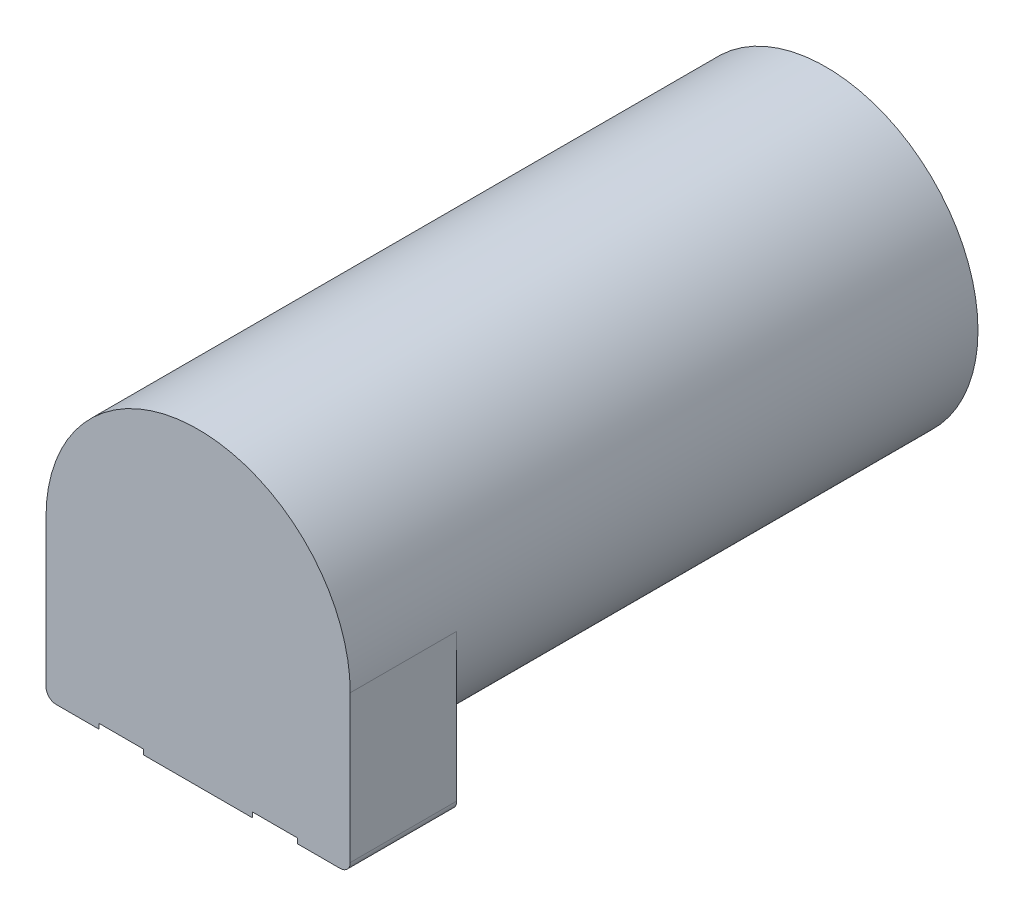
ISO-10303-21;
HEADER;
FILE_DESCRIPTION(('STEP AP214'),'2;1');
FILE_NAME('part.step','',(''),(''),'','','');
FILE_SCHEMA(('AUTOMOTIVE_DESIGN { 1 0 10303 214 1 1 1 1 }'));
ENDSEC;
DATA;
#1=APPLICATION_CONTEXT('core data for automotive mechanical design processes');
#2=APPLICATION_PROTOCOL_DEFINITION('international standard','automotive_design',2000,#1);
#3=PRODUCT_CONTEXT('',#1,'mechanical');
#4=PRODUCT('Part','Part','',(#3));
#5=PRODUCT_RELATED_PRODUCT_CATEGORY('part','',(#4));
#6=PRODUCT_DEFINITION_FORMATION('','',#4);
#7=PRODUCT_DEFINITION_CONTEXT('part definition',#1,'design');
#8=PRODUCT_DEFINITION('design','',#6,#7);
#9=PRODUCT_DEFINITION_SHAPE('','',#8);
#10=(LENGTH_UNIT() NAMED_UNIT(*) SI_UNIT(.MILLI.,.METRE.));
#11=(NAMED_UNIT(*) PLANE_ANGLE_UNIT() SI_UNIT($,.RADIAN.));
#12=(NAMED_UNIT(*) SI_UNIT($,.STERADIAN.) SOLID_ANGLE_UNIT());
#13=UNCERTAINTY_MEASURE_WITH_UNIT(LENGTH_MEASURE(1.E-05),#10,'distance_accuracy_value','');
#14=(GEOMETRIC_REPRESENTATION_CONTEXT(3) GLOBAL_UNCERTAINTY_ASSIGNED_CONTEXT((#13)) GLOBAL_UNIT_ASSIGNED_CONTEXT((#10,
#11,#12)) REPRESENTATION_CONTEXT('',''));
#15=CARTESIAN_POINT('',(0.,0.,0.));
#16=DIRECTION('',(0.,0.,1.));
#17=DIRECTION('',(1.,0.,0.));
#18=AXIS2_PLACEMENT_3D('',#15,#16,#17);
#19=CARTESIAN_POINT('',(-28.,-31.,102.8));
#20=DIRECTION('',(0.,-1.,0.));
#21=DIRECTION('',(1.,0.,0.));
#22=AXIS2_PLACEMENT_3D('',#19,#20,#21);
#23=PLANE('',#22);
#24=CARTESIAN_POINT('',(15.15,-31.,112.1));
#25=DIRECTION('',(0.,-1.,0.));
#26=DIRECTION('',(1.,0.,0.));
#27=AXIS2_PLACEMENT_3D('',#24,#25,#26);
#28=CIRCLE('',#27,12.5);
#29=CARTESIAN_POINT('',(10.75,-31.,123.8));
#30=VERTEX_POINT('',#29);
#31=CARTESIAN_POINT('',(6.79775479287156,-31.,102.8));
#32=VERTEX_POINT('',#31);
#33=EDGE_CURVE('E181',#30,#32,#28,.T.);
#34=ORIENTED_EDGE('',*,*,#33,.F.);
#35=DIRECTION('',(1.,0.,0.));
#36=VECTOR('',#35,1.);
#37=CARTESIAN_POINT('',(-28.,-31.,123.8));
#38=LINE('',#37,#36);
#39=CARTESIAN_POINT('',(-10.75,-31.,123.8));
#40=VERTEX_POINT('',#39);
#41=EDGE_CURVE('E216',#40,#30,#38,.T.);
#42=ORIENTED_EDGE('',*,*,#41,.F.);
#43=CARTESIAN_POINT('',(-15.15,-31.,112.1));
#44=DIRECTION('',(0.,-1.,0.));
#45=DIRECTION('',(1.,0.,0.));
#46=AXIS2_PLACEMENT_3D('',#43,#44,#45);
#47=CIRCLE('',#46,12.5);
#48=CARTESIAN_POINT('',(-6.79775479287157,-31.,102.8));
#49=VERTEX_POINT('',#48);
#50=EDGE_CURVE('E192',#49,#40,#47,.T.);
#51=ORIENTED_EDGE('',*,*,#50,.F.);
#52=DIRECTION('',(1.,0.,0.));
#53=VECTOR('',#52,1.);
#54=CARTESIAN_POINT('',(-28.,-31.,102.8));
#55=LINE('',#54,#53);
#56=EDGE_CURVE('E235',#49,#32,#55,.T.);
#57=ORIENTED_EDGE('',*,*,#56,.T.);
#58=EDGE_LOOP('',(#34,#42,#51,#57));
#59=FACE_BOUND('',#58,.T.);
#60=ADVANCED_FACE('F32',(#59),#23,.T.);
#61=CARTESIAN_POINT('',(-19.55,-31.,123.8));
#62=VERTEX_POINT('',#61);
#63=CARTESIAN_POINT('',(-23.5022452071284,-31.,102.8));
#64=VERTEX_POINT('',#63);
#65=EDGE_CURVE('E194',#62,#64,#47,.T.);
#66=ORIENTED_EDGE('',*,*,#65,.F.);
#67=CARTESIAN_POINT('',(-28.,-31.,123.8));
#68=VERTEX_POINT('',#67);
#69=EDGE_CURVE('E212',#68,#62,#38,.T.);
#70=ORIENTED_EDGE('',*,*,#69,.F.);
#71=DIRECTION('',(0.,0.,1.));
#72=VECTOR('',#71,1.);
#73=CARTESIAN_POINT('',(-28.,-31.,102.8));
#74=LINE('',#73,#72);
#75=CARTESIAN_POINT('',(-28.,-31.,102.8));
#76=VERTEX_POINT('',#75);
#77=EDGE_CURVE('E251',#76,#68,#74,.T.);
#78=ORIENTED_EDGE('',*,*,#77,.F.);
#79=EDGE_CURVE('E231',#76,#64,#55,.T.);
#80=ORIENTED_EDGE('',*,*,#79,.T.);
#81=EDGE_LOOP('',(#66,#70,#78,#80));
#82=FACE_BOUND('',#81,.T.);
#83=ADVANCED_FACE('F293',(#82),#23,.T.);
#84=CARTESIAN_POINT('',(0.,15.75,-5.));
#85=DIRECTION('',(0.,0.,1.));
#86=DIRECTION('',(1.,0.,0.));
#87=AXIS2_PLACEMENT_3D('',#84,#85,#86);
#88=PLANE('',#87);
#89=CARTESIAN_POINT('',(0.,0.,-5.));
#90=DIRECTION('',(0.,0.,1.));
#91=DIRECTION('',(1.,0.,0.));
#92=AXIS2_PLACEMENT_3D('',#89,#90,#91);
#93=CIRCLE('',#92,14.75);
#94=CARTESIAN_POINT('',(14.75,0.,-5.));
#95=VERTEX_POINT('',#94);
#96=EDGE_CURVE('E11',#95,#95,#93,.F.);
#97=ORIENTED_EDGE('',*,*,#96,.T.);
#98=EDGE_LOOP('',(#97));
#99=FACE_BOUND('',#98,.T.);
#100=ADVANCED_FACE('F34',(#99),#88,.F.);
#101=CARTESIAN_POINT('',(0.,0.,0.));
#102=DIRECTION('',(0.,0.,1.));
#103=DIRECTION('',(1.,0.,0.));
#104=AXIS2_PLACEMENT_3D('',#101,#102,#103);
#105=CYLINDRICAL_SURFACE('',#104,15.75);
#106=CARTESIAN_POINT('',(0.,0.,-4.00000000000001));
#107=DIRECTION('',(0.,0.,1.));
#108=DIRECTION('',(1.,0.,0.));
#109=AXIS2_PLACEMENT_3D('',#106,#107,#108);
#110=CIRCLE('',#109,15.75);
#111=CARTESIAN_POINT('',(15.75,0.,-4.00000000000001));
#112=VERTEX_POINT('',#111);
#113=EDGE_CURVE('E40',#112,#112,#110,.T.);
#114=ORIENTED_EDGE('',*,*,#113,.T.);
#115=EDGE_LOOP('',(#114));
#116=FACE_BOUND('',#115,.T.);
#117=CARTESIAN_POINT('',(0.,0.,0.));
#118=DIRECTION('',(0.,0.,1.));
#119=DIRECTION('',(1.,0.,0.));
#120=AXIS2_PLACEMENT_3D('',#117,#118,#119);
#121=CIRCLE('',#120,15.75);
#122=CARTESIAN_POINT('',(15.75,0.,0.));
#123=VERTEX_POINT('',#122);
#124=EDGE_CURVE('E262',#123,#123,#121,.T.);
#125=ORIENTED_EDGE('',*,*,#124,.F.);
#126=EDGE_LOOP('',(#125));
#127=FACE_BOUND('',#126,.T.);
#128=ADVANCED_FACE('F283',(#116,#127),#105,.T.);
#129=CARTESIAN_POINT('',(0.,0.,0.));
#130=DIRECTION('',(0.,0.,1.));
#131=DIRECTION('',(1.,0.,0.));
#132=AXIS2_PLACEMENT_3D('',#129,#130,#131);
#133=PLANE('',#132);
#134=CARTESIAN_POINT('',(0.,-22.5,0.));
#135=DIRECTION('',(0.,0.,-1.));
#136=DIRECTION('',(-1.,0.,0.));
#137=AXIS2_PLACEMENT_3D('',#134,#135,#136);
#138=CIRCLE('',#137,2.49999999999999);
#139=CARTESIAN_POINT('',(-2.5,-22.5,0.));
#140=VERTEX_POINT('',#139);
#141=EDGE_CURVE('E150',#140,#140,#138,.T.);
#142=ORIENTED_EDGE('',*,*,#141,.F.);
#143=EDGE_LOOP('',(#142));
#144=FACE_BOUND('',#143,.T.);
#145=CARTESIAN_POINT('',(-15.9099025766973,15.9099025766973,0.));
#146=DIRECTION('',(0.,0.,-1.));
#147=DIRECTION('',(-1.,0.,0.));
#148=AXIS2_PLACEMENT_3D('',#145,#146,#147);
#149=CIRCLE('',#148,2.49999999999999);
#150=CARTESIAN_POINT('',(-18.4099025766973,15.9099025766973,0.));
#151=VERTEX_POINT('',#150);
#152=EDGE_CURVE('E158',#151,#151,#149,.T.);
#153=ORIENTED_EDGE('',*,*,#152,.F.);
#154=EDGE_LOOP('',(#153));
#155=FACE_BOUND('',#154,.T.);
#156=CARTESIAN_POINT('',(15.9099025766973,15.9099025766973,0.));
#157=DIRECTION('',(0.,0.,-1.));
#158=DIRECTION('',(-1.,0.,0.));
#159=AXIS2_PLACEMENT_3D('',#156,#157,#158);
#160=CIRCLE('',#159,2.49999999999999);
#161=CARTESIAN_POINT('',(13.4099025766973,15.9099025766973,0.));
#162=VERTEX_POINT('',#161);
#163=EDGE_CURVE('E164',#162,#162,#160,.T.);
#164=ORIENTED_EDGE('',*,*,#163,.F.);
#165=EDGE_LOOP('',(#164));
#166=FACE_BOUND('',#165,.T.);
#167=CARTESIAN_POINT('',(0.,0.,0.));
#168=DIRECTION('',(0.,0.,1.));
#169=DIRECTION('',(1.,0.,0.));
#170=AXIS2_PLACEMENT_3D('',#167,#168,#169);
#171=CIRCLE('',#170,30.);
#172=CARTESIAN_POINT('',(30.,0.,0.));
#173=VERTEX_POINT('',#172);
#174=EDGE_CURVE('E245',#173,#173,#171,.T.);
#175=ORIENTED_EDGE('',*,*,#174,.F.);
#176=EDGE_LOOP('',(#175));
#177=FACE_BOUND('',#176,.T.);
#178=ORIENTED_EDGE('',*,*,#124,.T.);
#179=EDGE_LOOP('',(#178));
#180=FACE_BOUND('',#179,.T.);
#181=ADVANCED_FACE('F381',(#144,#155,#166,#177,#180),#133,.F.);
#182=CARTESIAN_POINT('',(0.,0.,123.8));
#183=DIRECTION('',(0.,0.,-1.));
#184=DIRECTION('',(-1.,0.,0.));
#185=AXIS2_PLACEMENT_3D('',#182,#183,#184);
#186=CYLINDRICAL_SURFACE('',#185,30.);
#187=CARTESIAN_POINT('',(0.,0.,123.8));
#188=DIRECTION('',(0.,0.,1.));
#189=DIRECTION('',(1.,0.,0.));
#190=AXIS2_PLACEMENT_3D('',#187,#188,#189);
#191=CIRCLE('',#190,30.);
#192=CARTESIAN_POINT('',(30.,0.,123.8));
#193=VERTEX_POINT('',#192);
#194=CARTESIAN_POINT('',(-30.,0.,123.8));
#195=VERTEX_POINT('',#194);
#196=EDGE_CURVE('E259',#193,#195,#191,.T.);
#197=ORIENTED_EDGE('',*,*,#196,.F.);
#198=DIRECTION('',(0.,0.,1.));
#199=VECTOR('',#198,1.);
#200=CARTESIAN_POINT('',(30.,0.,102.8));
#201=LINE('',#200,#199);
#202=CARTESIAN_POINT('',(30.,0.,102.8));
#203=VERTEX_POINT('',#202);
#204=EDGE_CURVE('E242',#203,#193,#201,.T.);
#205=ORIENTED_EDGE('',*,*,#204,.F.);
#206=CARTESIAN_POINT('',(0.,0.,102.8));
#207=DIRECTION('',(0.,0.,-1.));
#208=DIRECTION('',(1.,0.,0.));
#209=AXIS2_PLACEMENT_3D('',#206,#207,#208);
#210=CIRCLE('',#209,30.);
#211=CARTESIAN_POINT('',(-30.,0.,102.8));
#212=VERTEX_POINT('',#211);
#213=EDGE_CURVE('E221',#203,#212,#210,.T.);
#214=ORIENTED_EDGE('',*,*,#213,.T.);
#215=DIRECTION('',(0.,0.,1.));
#216=VECTOR('',#215,1.);
#217=CARTESIAN_POINT('',(-30.,0.,102.8));
#218=LINE('',#217,#216);
#219=EDGE_CURVE('E241',#212,#195,#218,.T.);
#220=ORIENTED_EDGE('',*,*,#219,.T.);
#221=EDGE_LOOP('',(#197,#205,#214,#220));
#222=FACE_BOUND('',#221,.T.);
#223=ORIENTED_EDGE('',*,*,#174,.T.);
#224=EDGE_LOOP('',(#223));
#225=FACE_BOUND('',#224,.T.);
#226=ADVANCED_FACE('F345',(#222,#225),#186,.T.);
#227=CARTESIAN_POINT('',(0.,0.,123.8));
#228=DIRECTION('',(0.,0.,1.));
#229=DIRECTION('',(1.,0.,0.));
#230=AXIS2_PLACEMENT_3D('',#227,#228,#229);
#231=PLANE('',#230);
#232=DIRECTION('',(0.,-1.,0.));
#233=VECTOR('',#232,1.);
#234=CARTESIAN_POINT('',(10.75,-30.,123.8));
#235=LINE('',#234,#233);
#236=CARTESIAN_POINT('',(10.75,-30.,123.8));
#237=VERTEX_POINT('',#236);
#238=EDGE_CURVE('E190',#237,#30,#235,.T.);
#239=ORIENTED_EDGE('',*,*,#238,.F.);
#240=DIRECTION('',(1.,0.,0.));
#241=VECTOR('',#240,1.);
#242=CARTESIAN_POINT('',(0.,-30.,123.8));
#243=LINE('',#242,#241);
#244=CARTESIAN_POINT('',(19.55,-30.,123.8));
#245=VERTEX_POINT('',#244);
#246=EDGE_CURVE('E185',#237,#245,#243,.T.);
#247=ORIENTED_EDGE('',*,*,#246,.T.);
#248=DIRECTION('',(0.,-1.,0.));
#249=VECTOR('',#248,1.);
#250=CARTESIAN_POINT('',(19.55,-30.,123.8));
#251=LINE('',#250,#249);
#252=CARTESIAN_POINT('',(19.55,-31.,123.8));
#253=VERTEX_POINT('',#252);
#254=EDGE_CURVE('E188',#253,#245,#251,.F.);
#255=ORIENTED_EDGE('',*,*,#254,.F.);
#256=CARTESIAN_POINT('',(28.,-31.,123.8));
#257=VERTEX_POINT('',#256);
#258=EDGE_CURVE('E211',#253,#257,#38,.T.);
#259=ORIENTED_EDGE('',*,*,#258,.T.);
#260=CARTESIAN_POINT('',(28.,-29.,123.8));
#261=DIRECTION('',(0.,0.,1.));
#262=DIRECTION('',(1.,0.,0.));
#263=AXIS2_PLACEMENT_3D('',#260,#261,#262);
#264=CIRCLE('',#263,2.00000000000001);
#265=CARTESIAN_POINT('',(30.,-29.,123.8));
#266=VERTEX_POINT('',#265);
#267=EDGE_CURVE('E215',#257,#266,#264,.T.);
#268=ORIENTED_EDGE('',*,*,#267,.T.);
#269=DIRECTION('',(0.,1.,0.));
#270=VECTOR('',#269,1.);
#271=CARTESIAN_POINT('',(30.,-29.,123.8));
#272=LINE('',#271,#270);
#273=EDGE_CURVE('E219',#266,#193,#272,.T.);
#274=ORIENTED_EDGE('',*,*,#273,.T.);
#275=ORIENTED_EDGE('',*,*,#196,.T.);
#276=DIRECTION('',(0.,-1.,0.));
#277=VECTOR('',#276,1.);
#278=CARTESIAN_POINT('',(-30.,0.,123.8));
#279=LINE('',#278,#277);
#280=CARTESIAN_POINT('',(-30.,-29.,123.8));
#281=VERTEX_POINT('',#280);
#282=EDGE_CURVE('E205',#195,#281,#279,.T.);
#283=ORIENTED_EDGE('',*,*,#282,.T.);
#284=CARTESIAN_POINT('',(-28.,-29.,123.8));
#285=DIRECTION('',(0.,0.,1.));
#286=DIRECTION('',(1.,0.,0.));
#287=AXIS2_PLACEMENT_3D('',#284,#285,#286);
#288=CIRCLE('',#287,2.);
#289=EDGE_CURVE('E208',#281,#68,#288,.T.);
#290=ORIENTED_EDGE('',*,*,#289,.T.);
#291=ORIENTED_EDGE('',*,*,#69,.T.);
#292=DIRECTION('',(0.,-1.,0.));
#293=VECTOR('',#292,1.);
#294=CARTESIAN_POINT('',(-19.55,-30.,123.8));
#295=LINE('',#294,#293);
#296=CARTESIAN_POINT('',(-19.55,-30.,123.8));
#297=VERTEX_POINT('',#296);
#298=EDGE_CURVE('E203',#297,#62,#295,.T.);
#299=ORIENTED_EDGE('',*,*,#298,.F.);
#300=DIRECTION('',(1.,0.,0.));
#301=VECTOR('',#300,1.);
#302=CARTESIAN_POINT('',(0.,-30.,123.8));
#303=LINE('',#302,#301);
#304=CARTESIAN_POINT('',(-10.75,-30.,123.8));
#305=VERTEX_POINT('',#304);
#306=EDGE_CURVE('E198',#297,#305,#303,.T.);
#307=ORIENTED_EDGE('',*,*,#306,.T.);
#308=DIRECTION('',(0.,-1.,0.));
#309=VECTOR('',#308,1.);
#310=CARTESIAN_POINT('',(-10.75,-30.,123.8));
#311=LINE('',#310,#309);
#312=EDGE_CURVE('E201',#40,#305,#311,.F.);
#313=ORIENTED_EDGE('',*,*,#312,.F.);
#314=ORIENTED_EDGE('',*,*,#41,.T.);
#315=EDGE_LOOP('',(#239,#247,#255,#259,#268,#274,#275,#283,#290,#291,#299,#307,#313,#314));
#316=FACE_BOUND('',#315,.T.);
#317=ADVANCED_FACE('F337',(#316),#231,.T.);
#318=CARTESIAN_POINT('',(30.,-29.,102.8));
#319=DIRECTION('',(1.,0.,0.));
#320=DIRECTION('',(0.,1.,0.));
#321=AXIS2_PLACEMENT_3D('',#318,#319,#320);
#322=PLANE('',#321);
#323=ORIENTED_EDGE('',*,*,#273,.F.);
#324=DIRECTION('',(0.,0.,1.));
#325=VECTOR('',#324,1.);
#326=CARTESIAN_POINT('',(30.,-29.,102.8));
#327=LINE('',#326,#325);
#328=CARTESIAN_POINT('',(30.,-29.,102.8));
#329=VERTEX_POINT('',#328);
#330=EDGE_CURVE('E246',#329,#266,#327,.T.);
#331=ORIENTED_EDGE('',*,*,#330,.F.);
#332=DIRECTION('',(0.,1.,0.));
#333=VECTOR('',#332,1.);
#334=CARTESIAN_POINT('',(30.,-29.,102.8));
#335=LINE('',#334,#333);
#336=EDGE_CURVE('E238',#329,#203,#335,.T.);
#337=ORIENTED_EDGE('',*,*,#336,.T.);
#338=ORIENTED_EDGE('',*,*,#204,.T.);
#339=EDGE_LOOP('',(#323,#331,#337,#338));
#340=FACE_BOUND('',#339,.T.);
#341=ADVANCED_FACE('F314',(#340),#322,.T.);
#342=CARTESIAN_POINT('',(28.,-29.,102.8));
#343=DIRECTION('',(0.,0.,1.));
#344=DIRECTION('',(1.,0.,0.));
#345=AXIS2_PLACEMENT_3D('',#342,#343,#344);
#346=CYLINDRICAL_SURFACE('',#345,2.00000000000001);
#347=ORIENTED_EDGE('',*,*,#267,.F.);
#348=DIRECTION('',(0.,0.,1.));
#349=VECTOR('',#348,1.);
#350=CARTESIAN_POINT('',(28.,-31.,102.8));
#351=LINE('',#350,#349);
#352=CARTESIAN_POINT('',(28.,-31.,102.8));
#353=VERTEX_POINT('',#352);
#354=EDGE_CURVE('E248',#353,#257,#351,.T.);
#355=ORIENTED_EDGE('',*,*,#354,.F.);
#356=CARTESIAN_POINT('',(28.,-29.,102.8));
#357=DIRECTION('',(0.,0.,1.));
#358=DIRECTION('',(1.,0.,0.));
#359=AXIS2_PLACEMENT_3D('',#356,#357,#358);
#360=CIRCLE('',#359,2.00000000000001);
#361=EDGE_CURVE('E234',#353,#329,#360,.T.);
#362=ORIENTED_EDGE('',*,*,#361,.T.);
#363=ORIENTED_EDGE('',*,*,#330,.T.);
#364=EDGE_LOOP('',(#347,#355,#362,#363));
#365=FACE_BOUND('',#364,.T.);
#366=ADVANCED_FACE('F306',(#365),#346,.T.);
#367=CARTESIAN_POINT('',(23.5022452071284,-31.,102.8));
#368=VERTEX_POINT('',#367);
#369=EDGE_CURVE('E179',#368,#253,#28,.T.);
#370=ORIENTED_EDGE('',*,*,#369,.F.);
#371=EDGE_CURVE('E230',#368,#353,#55,.T.);
#372=ORIENTED_EDGE('',*,*,#371,.T.);
#373=ORIENTED_EDGE('',*,*,#354,.T.);
#374=ORIENTED_EDGE('',*,*,#258,.F.);
#375=EDGE_LOOP('',(#370,#372,#373,#374));
#376=FACE_BOUND('',#375,.T.);
#377=ADVANCED_FACE('F296',(#376),#23,.T.);
#378=CARTESIAN_POINT('',(-28.,-29.,102.8));
#379=DIRECTION('',(0.,0.,1.));
#380=DIRECTION('',(1.,0.,0.));
#381=AXIS2_PLACEMENT_3D('',#378,#379,#380);
#382=CYLINDRICAL_SURFACE('',#381,2.);
#383=ORIENTED_EDGE('',*,*,#289,.F.);
#384=DIRECTION('',(0.,0.,1.));
#385=VECTOR('',#384,1.);
#386=CARTESIAN_POINT('',(-30.,-29.,102.8));
#387=LINE('',#386,#385);
#388=CARTESIAN_POINT('',(-30.,-29.,102.8));
#389=VERTEX_POINT('',#388);
#390=EDGE_CURVE('E253',#389,#281,#387,.T.);
#391=ORIENTED_EDGE('',*,*,#390,.F.);
#392=CARTESIAN_POINT('',(-28.,-29.,102.8));
#393=DIRECTION('',(0.,0.,1.));
#394=DIRECTION('',(1.,0.,0.));
#395=AXIS2_PLACEMENT_3D('',#392,#393,#394);
#396=CIRCLE('',#395,2.);
#397=EDGE_CURVE('E227',#389,#76,#396,.T.);
#398=ORIENTED_EDGE('',*,*,#397,.T.);
#399=ORIENTED_EDGE('',*,*,#77,.T.);
#400=EDGE_LOOP('',(#383,#391,#398,#399));
#401=FACE_BOUND('',#400,.T.);
#402=ADVANCED_FACE('F305',(#401),#382,.T.);
#403=CARTESIAN_POINT('',(-30.,0.,102.8));
#404=DIRECTION('',(-1.,0.,0.));
#405=DIRECTION('',(0.,0.,1.));
#406=AXIS2_PLACEMENT_3D('',#403,#404,#405);
#407=PLANE('',#406);
#408=ORIENTED_EDGE('',*,*,#282,.F.);
#409=ORIENTED_EDGE('',*,*,#219,.F.);
#410=DIRECTION('',(0.,-1.,0.));
#411=VECTOR('',#410,1.);
#412=CARTESIAN_POINT('',(-30.,0.,102.8));
#413=LINE('',#412,#411);
#414=EDGE_CURVE('E224',#212,#389,#413,.T.);
#415=ORIENTED_EDGE('',*,*,#414,.T.);
#416=ORIENTED_EDGE('',*,*,#390,.T.);
#417=EDGE_LOOP('',(#408,#409,#415,#416));
#418=FACE_BOUND('',#417,.T.);
#419=ADVANCED_FACE('F312',(#418),#407,.T.);
#420=CARTESIAN_POINT('',(0.,0.,102.8));
#421=DIRECTION('',(0.,0.,1.));
#422=DIRECTION('',(1.,0.,0.));
#423=AXIS2_PLACEMENT_3D('',#420,#421,#422);
#424=PLANE('',#423);
#425=DIRECTION('',(1.,0.,0.));
#426=VECTOR('',#425,1.);
#427=CARTESIAN_POINT('',(0.,-30.,102.8));
#428=LINE('',#427,#426);
#429=CARTESIAN_POINT('',(6.79775479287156,-30.,102.8));
#430=VERTEX_POINT('',#429);
#431=CARTESIAN_POINT('',(23.5022452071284,-30.,102.8));
#432=VERTEX_POINT('',#431);
#433=EDGE_CURVE('E273',#430,#432,#428,.T.);
#434=ORIENTED_EDGE('',*,*,#433,.F.);
#435=DIRECTION('',(0.,-1.,0.));
#436=VECTOR('',#435,1.);
#437=CARTESIAN_POINT('',(6.79775479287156,-30.,102.8));
#438=LINE('',#437,#436);
#439=EDGE_CURVE('E278',#430,#32,#438,.T.);
#440=ORIENTED_EDGE('',*,*,#439,.T.);
#441=ORIENTED_EDGE('',*,*,#56,.F.);
#442=DIRECTION('',(0.,-1.,0.));
#443=VECTOR('',#442,1.);
#444=CARTESIAN_POINT('',(-6.79775479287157,-30.,102.8));
#445=LINE('',#444,#443);
#446=CARTESIAN_POINT('',(-6.79775479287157,-30.,102.8));
#447=VERTEX_POINT('',#446);
#448=EDGE_CURVE('E267',#49,#447,#445,.F.);
#449=ORIENTED_EDGE('',*,*,#448,.T.);
#450=DIRECTION('',(1.,0.,0.));
#451=VECTOR('',#450,1.);
#452=CARTESIAN_POINT('',(0.,-30.,102.8));
#453=LINE('',#452,#451);
#454=CARTESIAN_POINT('',(-23.5022452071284,-30.,102.8));
#455=VERTEX_POINT('',#454);
#456=EDGE_CURVE('E265',#455,#447,#453,.T.);
#457=ORIENTED_EDGE('',*,*,#456,.F.);
#458=DIRECTION('',(0.,-1.,0.));
#459=VECTOR('',#458,1.);
#460=CARTESIAN_POINT('',(-23.5022452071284,-30.,102.8));
#461=LINE('',#460,#459);
#462=EDGE_CURVE('E270',#455,#64,#461,.T.);
#463=ORIENTED_EDGE('',*,*,#462,.T.);
#464=ORIENTED_EDGE('',*,*,#79,.F.);
#465=ORIENTED_EDGE('',*,*,#397,.F.);
#466=ORIENTED_EDGE('',*,*,#414,.F.);
#467=ORIENTED_EDGE('',*,*,#213,.F.);
#468=ORIENTED_EDGE('',*,*,#336,.F.);
#469=ORIENTED_EDGE('',*,*,#361,.F.);
#470=ORIENTED_EDGE('',*,*,#371,.F.);
#471=DIRECTION('',(0.,-1.,0.));
#472=VECTOR('',#471,1.);
#473=CARTESIAN_POINT('',(23.5022452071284,-30.,102.8));
#474=LINE('',#473,#472);
#475=EDGE_CURVE('E275',#368,#432,#474,.F.);
#476=ORIENTED_EDGE('',*,*,#475,.T.);
#477=EDGE_LOOP('',(#434,#440,#441,#449,#457,#463,#464,#465,#466,#467,#468,#469,#470,#476));
#478=FACE_BOUND('',#477,.T.);
#479=ADVANCED_FACE('F325',(#478),#424,.F.);
#480=CARTESIAN_POINT('',(-15.15,-30.,112.1));
#481=DIRECTION('',(0.,-1.,0.));
#482=DIRECTION('',(1.,0.,0.));
#483=AXIS2_PLACEMENT_3D('',#480,#481,#482);
#484=CYLINDRICAL_SURFACE('',#483,12.5);
#485=ORIENTED_EDGE('',*,*,#298,.T.);
#486=ORIENTED_EDGE('',*,*,#65,.T.);
#487=ORIENTED_EDGE('',*,*,#462,.F.);
#488=CARTESIAN_POINT('',(-15.15,-30.,112.1));
#489=DIRECTION('',(0.,-1.,0.));
#490=DIRECTION('',(1.,0.,0.));
#491=AXIS2_PLACEMENT_3D('',#488,#489,#490);
#492=CIRCLE('',#491,12.5);
#493=EDGE_CURVE('E55',#297,#455,#492,.T.);
#494=ORIENTED_EDGE('',*,*,#493,.F.);
#495=EDGE_LOOP('',(#485,#486,#487,#494));
#496=FACE_BOUND('',#495,.T.);
#497=ADVANCED_FACE('F356',(#496),#484,.F.);
#498=ORIENTED_EDGE('',*,*,#312,.T.);
#499=EDGE_CURVE('E195',#447,#305,#492,.T.);
#500=ORIENTED_EDGE('',*,*,#499,.F.);
#501=ORIENTED_EDGE('',*,*,#448,.F.);
#502=ORIENTED_EDGE('',*,*,#50,.T.);
#503=EDGE_LOOP('',(#498,#500,#501,#502));
#504=FACE_BOUND('',#503,.T.);
#505=ADVANCED_FACE('F360',(#504),#484,.F.);
#506=CARTESIAN_POINT('',(-15.15,-30.,112.1));
#507=DIRECTION('',(0.,-1.,0.));
#508=DIRECTION('',(1.,0.,0.));
#509=AXIS2_PLACEMENT_3D('',#506,#507,#508);
#510=PLANE('',#509);
#511=CARTESIAN_POINT('',(-15.15,-30.,112.1));
#512=DIRECTION('',(0.,-1.,0.));
#513=DIRECTION('',(1.,0.,0.));
#514=AXIS2_PLACEMENT_3D('',#511,#512,#513);
#515=CIRCLE('',#514,7.475);
#516=CARTESIAN_POINT('',(-7.67500000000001,-30.,112.1));
#517=VERTEX_POINT('',#516);
#518=EDGE_CURVE('E167',#517,#517,#515,.T.);
#519=ORIENTED_EDGE('',*,*,#518,.F.);
#520=EDGE_LOOP('',(#519));
#521=FACE_BOUND('',#520,.T.);
#522=ORIENTED_EDGE('',*,*,#493,.T.);
#523=ORIENTED_EDGE('',*,*,#456,.T.);
#524=ORIENTED_EDGE('',*,*,#499,.T.);
#525=ORIENTED_EDGE('',*,*,#306,.F.);
#526=EDGE_LOOP('',(#522,#523,#524,#525));
#527=FACE_BOUND('',#526,.T.);
#528=ADVANCED_FACE('F358',(#521,#527),#510,.T.);
#529=CARTESIAN_POINT('',(15.15,-30.,112.1));
#530=DIRECTION('',(0.,-1.,0.));
#531=DIRECTION('',(1.,0.,0.));
#532=AXIS2_PLACEMENT_3D('',#529,#530,#531);
#533=CYLINDRICAL_SURFACE('',#532,12.5);
#534=ORIENTED_EDGE('',*,*,#238,.T.);
#535=ORIENTED_EDGE('',*,*,#33,.T.);
#536=ORIENTED_EDGE('',*,*,#439,.F.);
#537=CARTESIAN_POINT('',(15.15,-30.,112.1));
#538=DIRECTION('',(0.,-1.,0.));
#539=DIRECTION('',(1.,0.,0.));
#540=AXIS2_PLACEMENT_3D('',#537,#538,#539);
#541=CIRCLE('',#540,12.5);
#542=EDGE_CURVE('E47',#237,#430,#541,.T.);
#543=ORIENTED_EDGE('',*,*,#542,.F.);
#544=EDGE_LOOP('',(#534,#535,#536,#543));
#545=FACE_BOUND('',#544,.T.);
#546=ADVANCED_FACE('F334',(#545),#533,.F.);
#547=ORIENTED_EDGE('',*,*,#254,.T.);
#548=EDGE_CURVE('E182',#432,#245,#541,.T.);
#549=ORIENTED_EDGE('',*,*,#548,.F.);
#550=ORIENTED_EDGE('',*,*,#475,.F.);
#551=ORIENTED_EDGE('',*,*,#369,.T.);
#552=EDGE_LOOP('',(#547,#549,#550,#551));
#553=FACE_BOUND('',#552,.T.);
#554=ADVANCED_FACE('F442',(#553),#533,.F.);
#555=CARTESIAN_POINT('',(15.15,-30.,112.1));
#556=DIRECTION('',(0.,-1.,0.));
#557=DIRECTION('',(1.,0.,0.));
#558=AXIS2_PLACEMENT_3D('',#555,#556,#557);
#559=PLANE('',#558);
#560=CARTESIAN_POINT('',(15.15,-30.,112.1));
#561=DIRECTION('',(0.,-1.,0.));
#562=DIRECTION('',(1.,0.,0.));
#563=AXIS2_PLACEMENT_3D('',#560,#561,#562);
#564=CIRCLE('',#563,7.475);
#565=CARTESIAN_POINT('',(22.625,-30.,112.1));
#566=VERTEX_POINT('',#565);
#567=EDGE_CURVE('E173',#566,#566,#564,.T.);
#568=ORIENTED_EDGE('',*,*,#567,.F.);
#569=EDGE_LOOP('',(#568));
#570=FACE_BOUND('',#569,.T.);
#571=ORIENTED_EDGE('',*,*,#542,.T.);
#572=ORIENTED_EDGE('',*,*,#433,.T.);
#573=ORIENTED_EDGE('',*,*,#548,.T.);
#574=ORIENTED_EDGE('',*,*,#246,.F.);
#575=EDGE_LOOP('',(#571,#572,#573,#574));
#576=FACE_BOUND('',#575,.T.);
#577=ADVANCED_FACE('F450',(#570,#576),#559,.T.);
#578=CARTESIAN_POINT('',(15.15,0.,112.1));
#579=DIRECTION('',(0.,-1.,0.));
#580=DIRECTION('',(1.,0.,0.));
#581=AXIS2_PLACEMENT_3D('',#578,#579,#580);
#582=CYLINDRICAL_SURFACE('',#581,7.475);
#583=CARTESIAN_POINT('',(15.15,0.,112.1));
#584=DIRECTION('',(0.,-1.,0.));
#585=DIRECTION('',(1.,0.,0.));
#586=AXIS2_PLACEMENT_3D('',#583,#584,#585);
#587=CIRCLE('',#586,7.475);
#588=CARTESIAN_POINT('',(22.625,0.,112.1));
#589=VERTEX_POINT('',#588);
#590=EDGE_CURVE('E176',#589,#589,#587,.T.);
#591=ORIENTED_EDGE('',*,*,#590,.F.);
#592=EDGE_LOOP('',(#591));
#593=FACE_BOUND('',#592,.T.);
#594=ORIENTED_EDGE('',*,*,#567,.T.);
#595=EDGE_LOOP('',(#594));
#596=FACE_BOUND('',#595,.T.);
#597=ADVANCED_FACE('F463',(#593,#596),#582,.F.);
#598=CARTESIAN_POINT('',(15.15,0.,112.1));
#599=DIRECTION('',(0.,-1.,0.));
#600=DIRECTION('',(1.,0.,0.));
#601=AXIS2_PLACEMENT_3D('',#598,#599,#600);
#602=PLANE('',#601);
#603=ORIENTED_EDGE('',*,*,#590,.T.);
#604=EDGE_LOOP('',(#603));
#605=FACE_BOUND('',#604,.T.);
#606=ADVANCED_FACE('F474',(#605),#602,.T.);
#607=CARTESIAN_POINT('',(-15.15,0.,112.1));
#608=DIRECTION('',(0.,-1.,0.));
#609=DIRECTION('',(1.,0.,0.));
#610=AXIS2_PLACEMENT_3D('',#607,#608,#609);
#611=CYLINDRICAL_SURFACE('',#610,7.475);
#612=CARTESIAN_POINT('',(-15.15,0.,112.1));
#613=DIRECTION('',(0.,-1.,0.));
#614=DIRECTION('',(1.,0.,0.));
#615=AXIS2_PLACEMENT_3D('',#612,#613,#614);
#616=CIRCLE('',#615,7.475);
#617=CARTESIAN_POINT('',(-7.67500000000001,0.,112.1));
#618=VERTEX_POINT('',#617);
#619=EDGE_CURVE('E170',#618,#618,#616,.T.);
#620=ORIENTED_EDGE('',*,*,#619,.F.);
#621=EDGE_LOOP('',(#620));
#622=FACE_BOUND('',#621,.T.);
#623=ORIENTED_EDGE('',*,*,#518,.T.);
#624=EDGE_LOOP('',(#623));
#625=FACE_BOUND('',#624,.T.);
#626=ADVANCED_FACE('F486',(#622,#625),#611,.F.);
#627=CARTESIAN_POINT('',(-15.15,0.,112.1));
#628=DIRECTION('',(0.,-1.,0.));
#629=DIRECTION('',(1.,0.,0.));
#630=AXIS2_PLACEMENT_3D('',#627,#628,#629);
#631=PLANE('',#630);
#632=ORIENTED_EDGE('',*,*,#619,.T.);
#633=EDGE_LOOP('',(#632));
#634=FACE_BOUND('',#633,.T.);
#635=ADVANCED_FACE('F496',(#634),#631,.T.);
#636=CARTESIAN_POINT('',(15.9099025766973,15.9099025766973,0.));
#637=DIRECTION('',(0.,0.,-1.));
#638=DIRECTION('',(-1.,0.,0.));
#639=AXIS2_PLACEMENT_3D('',#636,#637,#638);
#640=CYLINDRICAL_SURFACE('',#639,2.49999999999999);
#641=CARTESIAN_POINT('',(15.9099025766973,15.9099025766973,15.));
#642=DIRECTION('',(0.,0.,-1.));
#643=DIRECTION('',(-1.,0.,0.));
#644=AXIS2_PLACEMENT_3D('',#641,#642,#643);
#645=CIRCLE('',#644,2.5);
#646=CARTESIAN_POINT('',(13.4099025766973,15.9099025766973,15.));
#647=VERTEX_POINT('',#646);
#648=EDGE_CURVE('E161',#647,#647,#645,.T.);
#649=ORIENTED_EDGE('',*,*,#648,.F.);
#650=EDGE_LOOP('',(#649));
#651=FACE_BOUND('',#650,.T.);
#652=ORIENTED_EDGE('',*,*,#163,.T.);
#653=EDGE_LOOP('',(#652));
#654=FACE_BOUND('',#653,.T.);
#655=ADVANCED_FACE('F506',(#651,#654),#640,.F.);
#656=CARTESIAN_POINT('',(15.9099025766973,15.9099025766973,15.));
#657=DIRECTION('',(0.,0.,-1.));
#658=DIRECTION('',(-1.,0.,0.));
#659=AXIS2_PLACEMENT_3D('',#656,#657,#658);
#660=CONICAL_SURFACE('',#659,2.5,1.02974425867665);
#661=CARTESIAN_POINT('',(15.9099025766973,15.9099025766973,16.5021515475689));
#662=VERTEX_POINT('',#661);
#663=VERTEX_LOOP('',#662);
#664=FACE_BOUND('',#663,.T.);
#665=ORIENTED_EDGE('',*,*,#648,.T.);
#666=EDGE_LOOP('',(#665));
#667=FACE_BOUND('',#666,.T.);
#668=ADVANCED_FACE('F524',(#664,#667),#660,.F.);
#669=CARTESIAN_POINT('',(-15.9099025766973,15.9099025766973,0.));
#670=DIRECTION('',(0.,0.,-1.));
#671=DIRECTION('',(-1.,0.,0.));
#672=AXIS2_PLACEMENT_3D('',#669,#670,#671);
#673=CYLINDRICAL_SURFACE('',#672,2.49999999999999);
#674=CARTESIAN_POINT('',(-15.9099025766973,15.9099025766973,15.));
#675=DIRECTION('',(0.,0.,-1.));
#676=DIRECTION('',(-1.,0.,0.));
#677=AXIS2_PLACEMENT_3D('',#674,#675,#676);
#678=CIRCLE('',#677,2.5);
#679=CARTESIAN_POINT('',(-18.4099025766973,15.9099025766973,15.));
#680=VERTEX_POINT('',#679);
#681=EDGE_CURVE('E153',#680,#680,#678,.T.);
#682=ORIENTED_EDGE('',*,*,#681,.F.);
#683=EDGE_LOOP('',(#682));
#684=FACE_BOUND('',#683,.T.);
#685=ORIENTED_EDGE('',*,*,#152,.T.);
#686=EDGE_LOOP('',(#685));
#687=FACE_BOUND('',#686,.T.);
#688=ADVANCED_FACE('F535',(#684,#687),#673,.F.);
#689=CARTESIAN_POINT('',(-15.9099025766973,15.9099025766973,15.));
#690=DIRECTION('',(0.,0.,-1.));
#691=DIRECTION('',(-1.,0.,0.));
#692=AXIS2_PLACEMENT_3D('',#689,#690,#691);
#693=CONICAL_SURFACE('',#692,2.5,1.02974425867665);
#694=CARTESIAN_POINT('',(-15.9099025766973,15.9099025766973,16.5021515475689));
#695=VERTEX_POINT('',#694);
#696=VERTEX_LOOP('',#695);
#697=FACE_BOUND('',#696,.T.);
#698=ORIENTED_EDGE('',*,*,#681,.T.);
#699=EDGE_LOOP('',(#698));
#700=FACE_BOUND('',#699,.T.);
#701=ADVANCED_FACE('F545',(#697,#700),#693,.F.);
#702=CARTESIAN_POINT('',(0.,-22.5,0.));
#703=DIRECTION('',(0.,0.,-1.));
#704=DIRECTION('',(-1.,0.,0.));
#705=AXIS2_PLACEMENT_3D('',#702,#703,#704);
#706=CYLINDRICAL_SURFACE('',#705,2.49999999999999);
#707=CARTESIAN_POINT('',(0.,-22.5,15.));
#708=DIRECTION('',(0.,0.,-1.));
#709=DIRECTION('',(-1.,0.,0.));
#710=AXIS2_PLACEMENT_3D('',#707,#708,#709);
#711=CIRCLE('',#710,2.5);
#712=CARTESIAN_POINT('',(-2.5,-22.5,15.));
#713=VERTEX_POINT('',#712);
#714=EDGE_CURVE('E148',#713,#713,#711,.T.);
#715=ORIENTED_EDGE('',*,*,#714,.F.);
#716=EDGE_LOOP('',(#715));
#717=FACE_BOUND('',#716,.T.);
#718=ORIENTED_EDGE('',*,*,#141,.T.);
#719=EDGE_LOOP('',(#718));
#720=FACE_BOUND('',#719,.T.);
#721=ADVANCED_FACE('F144',(#717,#720),#706,.F.);
#722=CARTESIAN_POINT('',(0.,-22.5,15.));
#723=DIRECTION('',(0.,0.,-1.));
#724=DIRECTION('',(-1.,0.,0.));
#725=AXIS2_PLACEMENT_3D('',#722,#723,#724);
#726=CONICAL_SURFACE('',#725,2.5,1.02974425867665);
#727=CARTESIAN_POINT('',(0.,-22.5,16.5021515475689));
#728=VERTEX_POINT('',#727);
#729=VERTEX_LOOP('',#728);
#730=FACE_BOUND('',#729,.T.);
#731=ORIENTED_EDGE('',*,*,#714,.T.);
#732=EDGE_LOOP('',(#731));
#733=FACE_BOUND('',#732,.T.);
#734=ADVANCED_FACE('F140',(#730,#733),#726,.F.);
#735=CARTESIAN_POINT('',(0.,0.,-4.00000000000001));
#736=DIRECTION('',(0.,0.,1.));
#737=DIRECTION('',(1.,0.,0.));
#738=AXIS2_PLACEMENT_3D('',#735,#736,#737);
#739=CONICAL_SURFACE('',#738,15.75,0.785398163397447);
#740=ORIENTED_EDGE('',*,*,#96,.F.);
#741=EDGE_LOOP('',(#740));
#742=FACE_BOUND('',#741,.T.);
#743=ORIENTED_EDGE('',*,*,#113,.F.);
#744=EDGE_LOOP('',(#743));
#745=FACE_BOUND('',#744,.T.);
#746=ADVANCED_FACE('F143',(#742,#745),#739,.T.);
#747=CLOSED_SHELL('',(#60,#83,#100,#128,#181,#226,#317,#341,#366,#377,#402,#419,#479,#497,#505,
#528,#546,#554,#577,#597,#606,#626,#635,#655,#668,#688,#701,#721,#734,#746));
#748=MANIFOLD_SOLID_BREP('B2',#747);
#749=ADVANCED_BREP_SHAPE_REPRESENTATION('',(#18,#748),#14);
#750=SHAPE_DEFINITION_REPRESENTATION(#9,#749);
ENDSEC;
END-ISO-10303-21;
